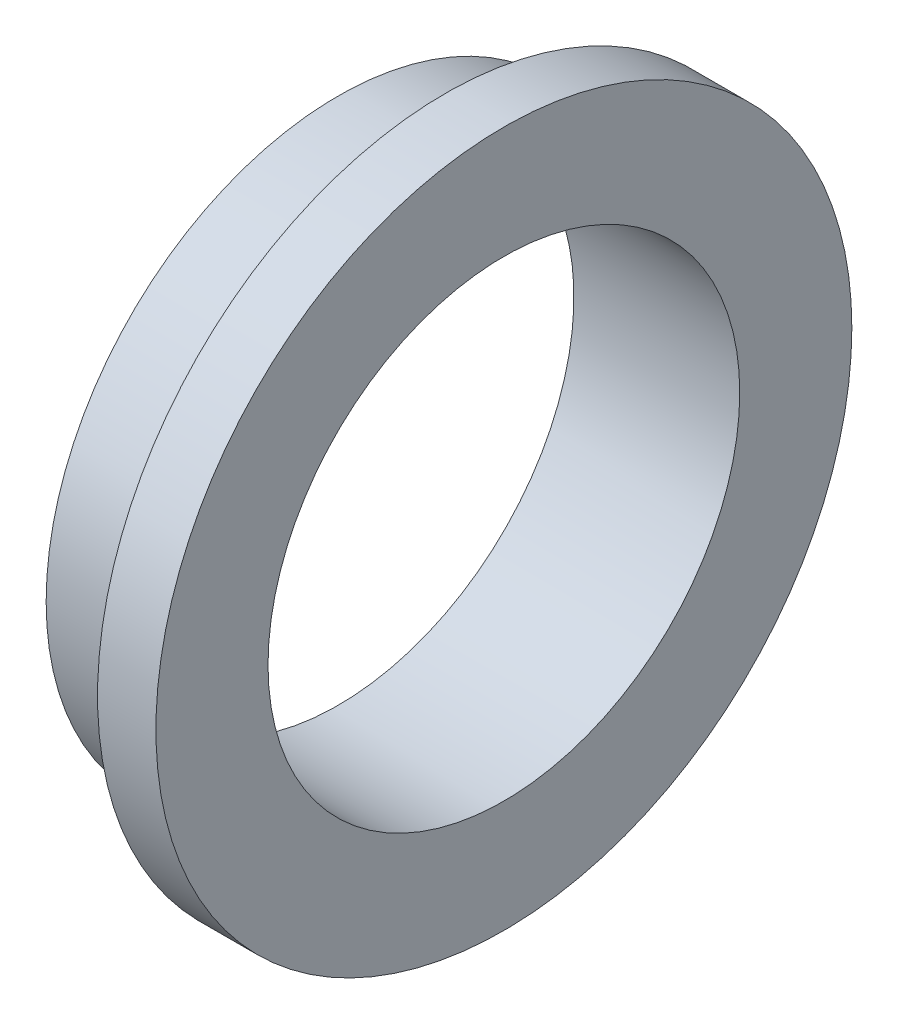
from build123d import *
from build123d.topology import SkipClean

# Parameters (mm, degrees)
SKETCH1_R           = 18.923
SKETCH1_R_2         = 12.827
BOSS_EXTRUDE1_DEPTH = 3.175
BOSS_EXTRUDE2_START = 5.842
SKETCH2_R           = 15.875
SKETCH2_R_2         = 12.827
BOSS_EXTRUDE2_DEPTH = 5.842


with BuildPart() as part:
    # Sketch1 → Boss-Extrude1 (new body)
    with BuildSketch(Plane(origin=(0, 0, 0), x_dir=(0, 0, -1), z_dir=(1, 0, 0))):
        Circle(SKETCH1_R)
        Circle(SKETCH1_R_2, mode=Mode.SUBTRACT)
    extrude(amount=BOSS_EXTRUDE1_DEPTH)

    # Sketch2 → Boss-Extrude2 (add)
    with SkipClean():  # the faces are left unmerged after this step: merging them gives an invalid solid
        with BuildSketch(Plane.ZY.offset(BOSS_EXTRUDE2_START)):
            with Locations(Location((0, 0, 0), (0, 0, 180))):
                Circle(SKETCH2_R)
            Circle(SKETCH2_R_2, mode=Mode.SUBTRACT)
        extrude(amount=-BOSS_EXTRUDE2_DEPTH)


solid = part.part
